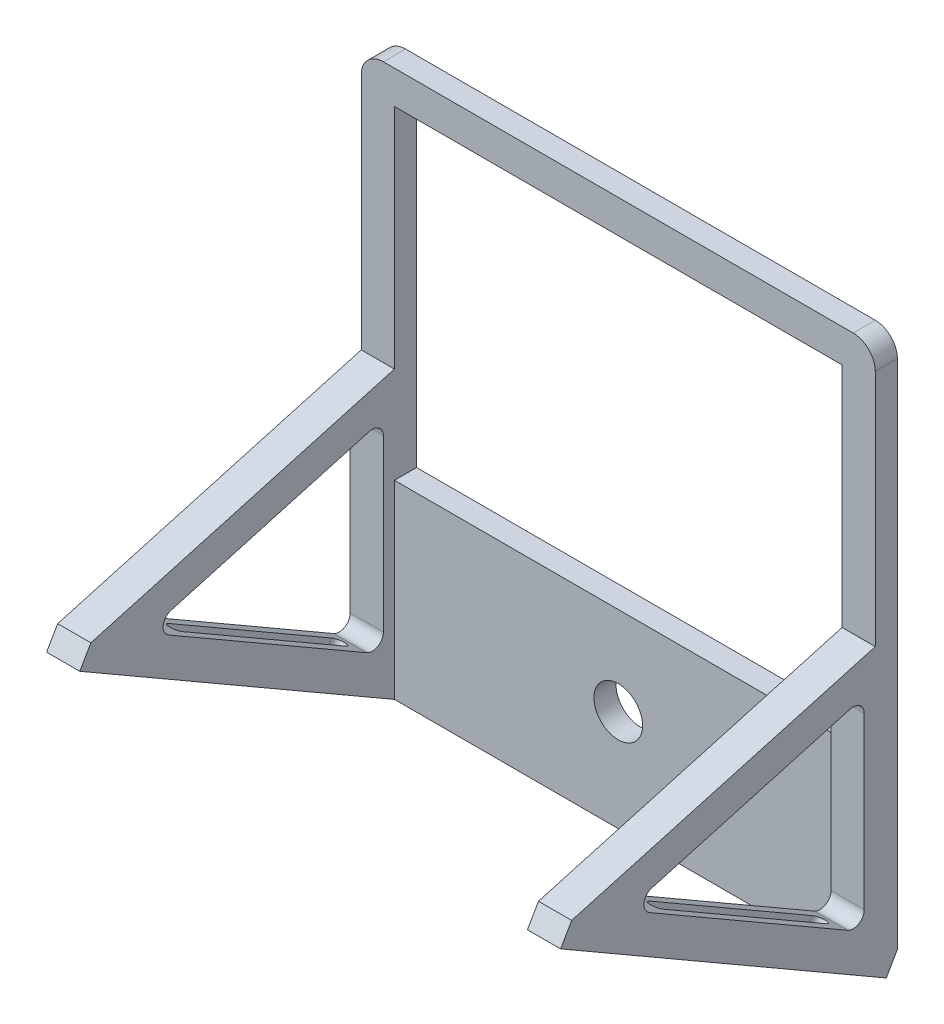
ISO-10303-21;
HEADER;
FILE_DESCRIPTION(('STEP AP214'),'2;1');
FILE_NAME('part.step','',(''),(''),'','','');
FILE_SCHEMA(('AUTOMOTIVE_DESIGN { 1 0 10303 214 1 1 1 1 }'));
ENDSEC;
DATA;
#1=APPLICATION_CONTEXT('core data for automotive mechanical design processes');
#2=APPLICATION_PROTOCOL_DEFINITION('international standard','automotive_design',2000,#1);
#3=PRODUCT_CONTEXT('',#1,'mechanical');
#4=PRODUCT('Part','Part','',(#3));
#5=PRODUCT_RELATED_PRODUCT_CATEGORY('part','',(#4));
#6=PRODUCT_DEFINITION_FORMATION('','',#4);
#7=PRODUCT_DEFINITION_CONTEXT('part definition',#1,'design');
#8=PRODUCT_DEFINITION('design','',#6,#7);
#9=PRODUCT_DEFINITION_SHAPE('','',#8);
#10=(LENGTH_UNIT() NAMED_UNIT(*) SI_UNIT(.MILLI.,.METRE.));
#11=(NAMED_UNIT(*) PLANE_ANGLE_UNIT() SI_UNIT($,.RADIAN.));
#12=(NAMED_UNIT(*) SI_UNIT($,.STERADIAN.) SOLID_ANGLE_UNIT());
#13=UNCERTAINTY_MEASURE_WITH_UNIT(LENGTH_MEASURE(1.E-05),#10,'distance_accuracy_value','');
#14=(GEOMETRIC_REPRESENTATION_CONTEXT(3) GLOBAL_UNCERTAINTY_ASSIGNED_CONTEXT((#13)) GLOBAL_UNIT_ASSIGNED_CONTEXT((#10,
#11,#12)) REPRESENTATION_CONTEXT('',''));
#15=CARTESIAN_POINT('',(0.,0.,0.));
#16=DIRECTION('',(0.,0.,1.));
#17=DIRECTION('',(1.,0.,0.));
#18=AXIS2_PLACEMENT_3D('',#15,#16,#17);
#19=CARTESIAN_POINT('',(-294.896248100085,-68.1660425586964,147.224318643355));
#20=DIRECTION('',(0.,0.5,0.866025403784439));
#21=DIRECTION('',(0.,-0.866025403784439,0.5));
#22=AXIS2_PLACEMENT_3D('',#19,#20,#21);
#23=PLANE('',#22);
#24=DIRECTION('',(0.,-0.866025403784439,0.5));
#25=VECTOR('',#24,1.);
#26=CARTESIAN_POINT('',(-101.166042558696,-68.1660425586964,147.224318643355));
#27=LINE('',#26,#25);
#28=CARTESIAN_POINT('',(-101.166042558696,-68.1660425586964,147.224318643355));
#29=VERTEX_POINT('',#28);
#30=CARTESIAN_POINT('',(-101.166042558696,-76.8262965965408,152.224318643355));
#31=VERTEX_POINT('',#30);
#32=EDGE_CURVE('E442',#29,#31,#27,.T.);
#33=ORIENTED_EDGE('',*,*,#32,.F.);
#34=DIRECTION('',(1.,0.,0.));
#35=VECTOR('',#34,1.);
#36=CARTESIAN_POINT('',(-294.896248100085,-68.1660425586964,147.224318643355));
#37=LINE('',#36,#35);
#38=CARTESIAN_POINT('',(-116.166042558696,-68.1660425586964,147.224318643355));
#39=VERTEX_POINT('',#38);
#40=EDGE_CURVE('E574',#39,#29,#37,.T.);
#41=ORIENTED_EDGE('',*,*,#40,.F.);
#42=DIRECTION('',(0.,0.866025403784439,-0.5));
#43=VECTOR('',#42,1.);
#44=CARTESIAN_POINT('',(-116.166042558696,-68.1660425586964,147.224318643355));
#45=LINE('',#44,#43);
#46=CARTESIAN_POINT('',(-116.166042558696,-76.8262965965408,152.224318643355));
#47=VERTEX_POINT('',#46);
#48=EDGE_CURVE('E543',#47,#39,#45,.T.);
#49=ORIENTED_EDGE('',*,*,#48,.F.);
#50=DIRECTION('',(1.,0.,0.));
#51=VECTOR('',#50,1.);
#52=CARTESIAN_POINT('',(-294.896248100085,-76.8262965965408,152.224318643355));
#53=LINE('',#52,#51);
#54=EDGE_CURVE('E569',#47,#31,#53,.T.);
#55=ORIENTED_EDGE('',*,*,#54,.T.);
#56=EDGE_LOOP('',(#33,#41,#49,#55));
#57=FACE_BOUND('',#56,.T.);
#58=ADVANCED_FACE('F45',(#57),#23,.T.);
#59=CARTESIAN_POINT('',(-297.004299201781,-29.6132486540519,10.));
#60=DIRECTION('',(0.,0.962726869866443,0.270475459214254));
#61=DIRECTION('',(0.,-0.270475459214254,0.962726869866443));
#62=AXIS2_PLACEMENT_3D('',#59,#60,#61);
#63=PLANE('',#62);
#64=DIRECTION('',(0.,-0.270475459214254,0.962726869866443));
#65=VECTOR('',#64,1.);
#66=CARTESIAN_POINT('',(-101.166042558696,-29.6132486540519,9.99999999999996));
#67=LINE('',#66,#65);
#68=CARTESIAN_POINT('',(-101.166042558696,-29.6132486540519,10.));
#69=VERTEX_POINT('',#68);
#70=EDGE_CURVE('E439',#69,#29,#67,.T.);
#71=ORIENTED_EDGE('',*,*,#70,.F.);
#72=DIRECTION('',(1.,0.,0.));
#73=VECTOR('',#72,1.);
#74=CARTESIAN_POINT('',(-297.004299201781,-29.6132486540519,10.));
#75=LINE('',#74,#73);
#76=CARTESIAN_POINT('',(-116.166042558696,-29.6132486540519,10.));
#77=VERTEX_POINT('',#76);
#78=EDGE_CURVE('E536',#77,#69,#75,.T.);
#79=ORIENTED_EDGE('',*,*,#78,.F.);
#80=DIRECTION('',(0.,0.270475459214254,-0.962726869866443));
#81=VECTOR('',#80,1.);
#82=CARTESIAN_POINT('',(-116.166042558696,-29.6132486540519,10.));
#83=LINE('',#82,#81);
#84=EDGE_CURVE('E473',#39,#77,#83,.T.);
#85=ORIENTED_EDGE('',*,*,#84,.F.);
#86=ORIENTED_EDGE('',*,*,#40,.T.);
#87=EDGE_LOOP('',(#71,#79,#85,#86));
#88=FACE_BOUND('',#87,.T.);
#89=ADVANCED_FACE('F715',(#88),#63,.T.);
#90=CARTESIAN_POINT('',(-297.004299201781,-130.072031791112,15.));
#91=DIRECTION('',(0.,0.,-1.));
#92=DIRECTION('',(0.,1.,0.));
#93=AXIS2_PLACEMENT_3D('',#90,#91,#92);
#94=PLANE('',#93);
#95=DIRECTION('',(1.,0.,0.));
#96=VECTOR('',#95,1.);
#97=CARTESIAN_POINT('',(-297.004299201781,-130.072031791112,15.));
#98=LINE('',#97,#96);
#99=CARTESIAN_POINT('',(-116.166042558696,-130.072031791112,15.));
#100=VERTEX_POINT('',#99);
#101=CARTESIAN_POINT('',(-101.166042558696,-130.072031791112,15.));
#102=VERTEX_POINT('',#101);
#103=EDGE_CURVE('E528',#100,#102,#98,.T.);
#104=ORIENTED_EDGE('',*,*,#103,.T.);
#105=DIRECTION('',(0.,1.,0.));
#106=VECTOR('',#105,1.);
#107=CARTESIAN_POINT('',(-101.166042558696,-130.072031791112,15.));
#108=LINE('',#107,#106);
#109=CARTESIAN_POINT('',(-101.166042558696,-53.197045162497,15.));
#110=VERTEX_POINT('',#109);
#111=EDGE_CURVE('E435',#102,#110,#108,.T.);
#112=ORIENTED_EDGE('',*,*,#111,.T.);
#113=DIRECTION('',(1.,0.,0.));
#114=VECTOR('',#113,1.);
#115=CARTESIAN_POINT('',(-297.004299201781,-53.1970451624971,15.));
#116=LINE('',#115,#114);
#117=CARTESIAN_POINT('',(-116.166042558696,-53.197045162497,15.));
#118=VERTEX_POINT('',#117);
#119=EDGE_CURVE('E523',#118,#110,#116,.T.);
#120=ORIENTED_EDGE('',*,*,#119,.F.);
#121=DIRECTION('',(0.,-1.,0.));
#122=VECTOR('',#121,1.);
#123=CARTESIAN_POINT('',(-116.166042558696,-130.072031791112,15.));
#124=LINE('',#123,#122);
#125=EDGE_CURVE('E477',#118,#100,#124,.T.);
#126=ORIENTED_EDGE('',*,*,#125,.T.);
#127=EDGE_LOOP('',(#104,#112,#120,#126));
#128=FACE_BOUND('',#127,.T.);
#129=ADVANCED_FACE('F803',(#128),#94,.F.);
#130=CARTESIAN_POINT('',(-297.004299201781,-53.1970451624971,20.));
#131=DIRECTION('',(1.,0.,0.));
#132=DIRECTION('',(0.,1.,0.));
#133=AXIS2_PLACEMENT_3D('',#130,#131,#132);
#134=CYLINDRICAL_SURFACE('',#133,5.);
#135=ORIENTED_EDGE('',*,*,#119,.T.);
#136=CARTESIAN_POINT('',(-101.166042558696,-53.1970451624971,20.));
#137=DIRECTION('',(-1.,0.,0.));
#138=DIRECTION('',(0.,0.,1.));
#139=AXIS2_PLACEMENT_3D('',#136,#137,#138);
#140=CIRCLE('',#139,5.);
#141=CARTESIAN_POINT('',(-101.166042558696,-48.3834108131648,21.3523772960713));
#142=VERTEX_POINT('',#141);
#143=EDGE_CURVE('E431',#110,#142,#140,.F.);
#144=ORIENTED_EDGE('',*,*,#143,.T.);
#145=DIRECTION('',(1.,0.,0.));
#146=VECTOR('',#145,1.);
#147=CARTESIAN_POINT('',(-297.004299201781,-48.3834108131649,21.3523772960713));
#148=LINE('',#147,#146);
#149=CARTESIAN_POINT('',(-116.166042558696,-48.3834108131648,21.3523772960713));
#150=VERTEX_POINT('',#149);
#151=EDGE_CURVE('E518',#150,#142,#148,.T.);
#152=ORIENTED_EDGE('',*,*,#151,.F.);
#153=CARTESIAN_POINT('',(-116.166042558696,-53.1970451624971,20.));
#154=DIRECTION('',(1.,0.,0.));
#155=DIRECTION('',(0.,1.,0.));
#156=AXIS2_PLACEMENT_3D('',#153,#154,#155);
#157=CIRCLE('',#156,5.);
#158=EDGE_CURVE('E452',#150,#118,#157,.F.);
#159=ORIENTED_EDGE('',*,*,#158,.T.);
#160=EDGE_LOOP('',(#135,#144,#152,#159));
#161=FACE_BOUND('',#160,.T.);
#162=ADVANCED_FACE('F827',(#161),#134,.F.);
#163=CARTESIAN_POINT('',(-297.004299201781,-48.3834108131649,21.3523772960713));
#164=DIRECTION('',(0.,0.962726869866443,0.270475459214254));
#165=DIRECTION('',(0.,-0.270475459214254,0.962726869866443));
#166=AXIS2_PLACEMENT_3D('',#163,#164,#165);
#167=PLANE('',#166);
#168=ORIENTED_EDGE('',*,*,#151,.T.);
#169=DIRECTION('',(0.,-0.270475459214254,0.962726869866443));
#170=VECTOR('',#169,1.);
#171=CARTESIAN_POINT('',(-101.166042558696,-48.3834108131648,21.3523772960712));
#172=LINE('',#171,#170);
#173=CARTESIAN_POINT('',(-101.166042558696,-73.5469644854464,110.919206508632));
#174=VERTEX_POINT('',#173);
#175=EDGE_CURVE('E427',#142,#174,#172,.T.);
#176=ORIENTED_EDGE('',*,*,#175,.T.);
#177=DIRECTION('',(1.,0.,0.));
#178=VECTOR('',#177,1.);
#179=CARTESIAN_POINT('',(-297.004299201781,-73.5469644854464,110.919206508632));
#180=LINE('',#179,#178);
#181=CARTESIAN_POINT('',(-116.166042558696,-73.5469644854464,110.919206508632));
#182=VERTEX_POINT('',#181);
#183=EDGE_CURVE('E513',#182,#174,#180,.T.);
#184=ORIENTED_EDGE('',*,*,#183,.F.);
#185=DIRECTION('',(0.,0.270475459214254,-0.962726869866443));
#186=VECTOR('',#185,1.);
#187=CARTESIAN_POINT('',(-116.166042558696,-48.3834108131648,21.3523772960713));
#188=LINE('',#187,#186);
#189=EDGE_CURVE('E457',#182,#150,#188,.T.);
#190=ORIENTED_EDGE('',*,*,#189,.T.);
#191=EDGE_LOOP('',(#168,#176,#184,#190));
#192=FACE_BOUND('',#191,.T.);
#193=ADVANCED_FACE('F829',(#192),#167,.F.);
#194=CARTESIAN_POINT('',(-297.004299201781,-78.3605988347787,109.56682921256));
#195=DIRECTION('',(1.,0.,0.));
#196=DIRECTION('',(0.,1.,0.));
#197=AXIS2_PLACEMENT_3D('',#194,#195,#196);
#198=CYLINDRICAL_SURFACE('',#197,5.);
#199=ORIENTED_EDGE('',*,*,#183,.T.);
#200=CARTESIAN_POINT('',(-101.166042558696,-78.3605988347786,109.56682921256));
#201=DIRECTION('',(-1.,0.,0.));
#202=DIRECTION('',(0.,0.,1.));
#203=AXIS2_PLACEMENT_3D('',#200,#201,#202);
#204=CIRCLE('',#203,5.);
#205=CARTESIAN_POINT('',(-101.166042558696,-82.6907258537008,112.06682921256));
#206=VERTEX_POINT('',#205);
#207=EDGE_CURVE('E423',#174,#206,#204,.F.);
#208=ORIENTED_EDGE('',*,*,#207,.T.);
#209=DIRECTION('',(1.,0.,0.));
#210=VECTOR('',#209,1.);
#211=CARTESIAN_POINT('',(-297.004299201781,-82.6907258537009,112.06682921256));
#212=LINE('',#211,#210);
#213=CARTESIAN_POINT('',(-116.166042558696,-82.6907258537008,112.06682921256));
#214=VERTEX_POINT('',#213);
#215=EDGE_CURVE('E508',#214,#206,#212,.T.);
#216=ORIENTED_EDGE('',*,*,#215,.F.);
#217=CARTESIAN_POINT('',(-116.166042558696,-78.3605988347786,109.56682921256));
#218=DIRECTION('',(1.,0.,0.));
#219=DIRECTION('',(0.,1.,0.));
#220=AXIS2_PLACEMENT_3D('',#217,#218,#219);
#221=CIRCLE('',#220,5.);
#222=EDGE_CURVE('E461',#214,#182,#221,.F.);
#223=ORIENTED_EDGE('',*,*,#222,.T.);
#224=EDGE_LOOP('',(#199,#208,#216,#223));
#225=FACE_BOUND('',#224,.T.);
#226=ADVANCED_FACE('F793',(#225),#198,.F.);
#227=CARTESIAN_POINT('',(-297.004299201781,-82.6907258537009,112.06682921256));
#228=DIRECTION('',(0.,-0.866025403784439,0.5));
#229=DIRECTION('',(0.,-0.5,-0.866025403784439));
#230=AXIS2_PLACEMENT_3D('',#227,#228,#229);
#231=PLANE('',#230);
#232=DIRECTION('',(0.,-0.5,-0.866025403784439));
#233=VECTOR('',#232,1.);
#234=CARTESIAN_POINT('',(-105.466042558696,-88.835915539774,101.423048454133));
#235=LINE('',#234,#233);
#236=CARTESIAN_POINT('',(-105.466042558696,-88.8359155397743,101.423048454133));
#237=VERTEX_POINT('',#236);
#238=CARTESIAN_POINT('',(-105.466042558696,-131.335915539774,27.8108891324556));
#239=VERTEX_POINT('',#238);
#240=EDGE_CURVE('E301',#237,#239,#235,.T.);
#241=ORIENTED_EDGE('',*,*,#240,.F.);
#242=CARTESIAN_POINT('',(-108.666042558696,-88.8359155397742,101.423048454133));
#243=DIRECTION('',(0.,-0.866025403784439,0.5));
#244=DIRECTION('',(0.,-0.5,-0.866025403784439));
#245=AXIS2_PLACEMENT_3D('',#242,#243,#244);
#246=CIRCLE('',#245,3.19999999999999);
#247=CARTESIAN_POINT('',(-111.866042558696,-88.8359155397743,101.423048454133));
#248=VERTEX_POINT('',#247);
#249=EDGE_CURVE('E309',#248,#237,#246,.F.);
#250=ORIENTED_EDGE('',*,*,#249,.F.);
#251=DIRECTION('',(0.,0.5,0.866025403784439));
#252=VECTOR('',#251,1.);
#253=CARTESIAN_POINT('',(-111.866042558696,-88.835915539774,101.423048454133));
#254=LINE('',#253,#252);
#255=CARTESIAN_POINT('',(-111.866042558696,-131.335915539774,27.8108891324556));
#256=VERTEX_POINT('',#255);
#257=EDGE_CURVE('E315',#256,#248,#254,.T.);
#258=ORIENTED_EDGE('',*,*,#257,.F.);
#259=CARTESIAN_POINT('',(-108.666042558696,-131.335915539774,27.8108891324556));
#260=DIRECTION('',(0.,-0.866025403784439,0.5));
#261=DIRECTION('',(0.,-0.5,-0.866025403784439));
#262=AXIS2_PLACEMENT_3D('',#259,#260,#261);
#263=CIRCLE('',#262,3.19999999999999);
#264=EDGE_CURVE('E64',#239,#256,#263,.F.);
#265=ORIENTED_EDGE('',*,*,#264,.F.);
#266=EDGE_LOOP('',(#241,#250,#258,#265));
#267=FACE_BOUND('',#266,.T.);
#268=ORIENTED_EDGE('',*,*,#215,.T.);
#269=DIRECTION('',(0.,-0.5,-0.866025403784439));
#270=VECTOR('',#269,1.);
#271=CARTESIAN_POINT('',(-101.166042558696,-82.6907258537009,112.06682921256));
#272=LINE('',#271,#270);
#273=CARTESIAN_POINT('',(-101.166042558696,-134.402158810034,22.5));
#274=VERTEX_POINT('',#273);
#275=EDGE_CURVE('E419',#206,#274,#272,.T.);
#276=ORIENTED_EDGE('',*,*,#275,.T.);
#277=DIRECTION('',(1.,0.,0.));
#278=VECTOR('',#277,1.);
#279=CARTESIAN_POINT('',(-297.004299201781,-134.402158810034,22.5));
#280=LINE('',#279,#278);
#281=CARTESIAN_POINT('',(-116.166042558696,-134.402158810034,22.5));
#282=VERTEX_POINT('',#281);
#283=EDGE_CURVE('E502',#282,#274,#280,.T.);
#284=ORIENTED_EDGE('',*,*,#283,.F.);
#285=DIRECTION('',(0.,0.5,0.866025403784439));
#286=VECTOR('',#285,1.);
#287=CARTESIAN_POINT('',(-116.166042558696,-82.6907258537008,112.06682921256));
#288=LINE('',#287,#286);
#289=EDGE_CURVE('E465',#282,#214,#288,.T.);
#290=ORIENTED_EDGE('',*,*,#289,.T.);
#291=EDGE_LOOP('',(#268,#276,#284,#290));
#292=FACE_BOUND('',#291,.T.);
#293=ADVANCED_FACE('F317',(#267,#292),#231,.F.);
#294=CARTESIAN_POINT('',(-297.004299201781,-130.072031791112,20.));
#295=DIRECTION('',(1.,0.,0.));
#296=DIRECTION('',(0.,1.,0.));
#297=AXIS2_PLACEMENT_3D('',#294,#295,#296);
#298=CYLINDRICAL_SURFACE('',#297,5.);
#299=ORIENTED_EDGE('',*,*,#283,.T.);
#300=CARTESIAN_POINT('',(-101.166042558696,-130.072031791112,20.));
#301=DIRECTION('',(-1.,0.,0.));
#302=DIRECTION('',(0.,0.,1.));
#303=AXIS2_PLACEMENT_3D('',#300,#301,#302);
#304=CIRCLE('',#303,5.);
#305=EDGE_CURVE('E651',#274,#102,#304,.F.);
#306=ORIENTED_EDGE('',*,*,#305,.T.);
#307=ORIENTED_EDGE('',*,*,#103,.F.);
#308=CARTESIAN_POINT('',(-116.166042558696,-130.072031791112,20.));
#309=DIRECTION('',(1.,0.,0.));
#310=DIRECTION('',(0.,1.,0.));
#311=AXIS2_PLACEMENT_3D('',#308,#309,#310);
#312=CIRCLE('',#311,5.);
#313=EDGE_CURVE('E469',#100,#282,#312,.F.);
#314=ORIENTED_EDGE('',*,*,#313,.T.);
#315=EDGE_LOOP('',(#299,#306,#307,#314));
#316=FACE_BOUND('',#315,.T.);
#317=ADVANCED_FACE('F791',(#316),#298,.F.);
#318=CARTESIAN_POINT('',(0.,0.,10.));
#319=DIRECTION('',(0.,0.,1.));
#320=DIRECTION('',(1.,0.,0.));
#321=AXIS2_PLACEMENT_3D('',#318,#319,#320);
#322=PLANE('',#321);
#323=DIRECTION('',(0.,1.,0.));
#324=VECTOR('',#323,1.);
#325=CARTESIAN_POINT('',(116.166042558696,88.1660425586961,10.));
#326=LINE('',#325,#324);
#327=CARTESIAN_POINT('',(116.166042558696,-29.6132486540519,10.));
#328=VERTEX_POINT('',#327);
#329=CARTESIAN_POINT('',(116.166042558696,78.1660425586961,10.));
#330=VERTEX_POINT('',#329);
#331=EDGE_CURVE('E625',#328,#330,#326,.T.);
#332=ORIENTED_EDGE('',*,*,#331,.T.);
#333=CARTESIAN_POINT('',(106.166042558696,78.1660425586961,10.));
#334=DIRECTION('',(0.,0.,1.));
#335=DIRECTION('',(1.,0.,0.));
#336=AXIS2_PLACEMENT_3D('',#333,#334,#335);
#337=CIRCLE('',#336,10.);
#338=CARTESIAN_POINT('',(106.166042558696,88.1660425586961,10.));
#339=VERTEX_POINT('',#338);
#340=EDGE_CURVE('E54',#330,#339,#337,.T.);
#341=ORIENTED_EDGE('',*,*,#340,.T.);
#342=DIRECTION('',(-1.,0.,0.));
#343=VECTOR('',#342,1.);
#344=CARTESIAN_POINT('',(-116.166042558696,88.1660425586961,10.));
#345=LINE('',#344,#343);
#346=CARTESIAN_POINT('',(-106.166042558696,88.1660425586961,10.));
#347=VERTEX_POINT('',#346);
#348=EDGE_CURVE('E630',#339,#347,#345,.T.);
#349=ORIENTED_EDGE('',*,*,#348,.T.);
#350=CARTESIAN_POINT('',(-106.166042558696,78.1660425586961,10.));
#351=DIRECTION('',(0.,0.,1.));
#352=DIRECTION('',(1.,0.,0.));
#353=AXIS2_PLACEMENT_3D('',#350,#351,#352);
#354=CIRCLE('',#353,10.);
#355=CARTESIAN_POINT('',(-116.166042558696,78.1660425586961,10.));
#356=VERTEX_POINT('',#355);
#357=EDGE_CURVE('E671',#347,#356,#354,.T.);
#358=ORIENTED_EDGE('',*,*,#357,.T.);
#359=DIRECTION('',(0.,-1.,0.));
#360=VECTOR('',#359,1.);
#361=CARTESIAN_POINT('',(-116.166042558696,88.1660425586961,10.));
#362=LINE('',#361,#360);
#363=EDGE_CURVE('E622',#356,#77,#362,.T.);
#364=ORIENTED_EDGE('',*,*,#363,.T.);
#365=ORIENTED_EDGE('',*,*,#78,.T.);
#366=DIRECTION('',(0.,-1.,0.));
#367=VECTOR('',#366,1.);
#368=CARTESIAN_POINT('',(-101.166042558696,73.1660425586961,10.));
#369=LINE('',#368,#367);
#370=CARTESIAN_POINT('',(-101.166042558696,73.1660425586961,10.));
#371=VERTEX_POINT('',#370);
#372=EDGE_CURVE('E578',#371,#69,#369,.T.);
#373=ORIENTED_EDGE('',*,*,#372,.F.);
#374=DIRECTION('',(-1.,0.,0.));
#375=VECTOR('',#374,1.);
#376=CARTESIAN_POINT('',(-101.166042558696,73.1660425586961,10.));
#377=LINE('',#376,#375);
#378=CARTESIAN_POINT('',(101.166042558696,73.1660425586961,10.));
#379=VERTEX_POINT('',#378);
#380=EDGE_CURVE('E590',#379,#371,#377,.T.);
#381=ORIENTED_EDGE('',*,*,#380,.F.);
#382=DIRECTION('',(0.,1.,0.));
#383=VECTOR('',#382,1.);
#384=CARTESIAN_POINT('',(101.166042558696,73.1660425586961,10.));
#385=LINE('',#384,#383);
#386=CARTESIAN_POINT('',(101.166042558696,-29.6132486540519,10.));
#387=VERTEX_POINT('',#386);
#388=EDGE_CURVE('E587',#387,#379,#385,.T.);
#389=ORIENTED_EDGE('',*,*,#388,.F.);
#390=EDGE_CURVE('E535',#387,#328,#75,.T.);
#391=ORIENTED_EDGE('',*,*,#390,.T.);
#392=EDGE_LOOP('',(#332,#341,#349,#358,#364,#365,#373,#381,#389,#391));
#393=FACE_BOUND('',#392,.T.);
#394=ADVANCED_FACE('F677',(#393),#322,.T.);
#395=CARTESIAN_POINT('',(0.,0.,0.));
#396=DIRECTION('',(0.,0.,1.));
#397=DIRECTION('',(1.,0.,0.));
#398=AXIS2_PLACEMENT_3D('',#395,#396,#397);
#399=PLANE('',#398);
#400=CARTESIAN_POINT('',(0.,-113.166042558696,0.));
#401=DIRECTION('',(0.,0.,-1.));
#402=DIRECTION('',(-1.,0.,0.));
#403=AXIS2_PLACEMENT_3D('',#400,#401,#402);
#404=CIRCLE('',#403,11.);
#405=CARTESIAN_POINT('',(-11.,-113.166042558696,0.));
#406=VERTEX_POINT('',#405);
#407=EDGE_CURVE('E322',#406,#406,#404,.T.);
#408=ORIENTED_EDGE('',*,*,#407,.F.);
#409=EDGE_LOOP('',(#408));
#410=FACE_BOUND('',#409,.T.);
#411=DIRECTION('',(-1.,0.,0.));
#412=VECTOR('',#411,1.);
#413=CARTESIAN_POINT('',(-116.166042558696,88.1660425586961,0.));
#414=LINE('',#413,#412);
#415=CARTESIAN_POINT('',(106.166042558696,88.1660425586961,0.));
#416=VERTEX_POINT('',#415);
#417=CARTESIAN_POINT('',(-106.166042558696,88.1660425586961,0.));
#418=VERTEX_POINT('',#417);
#419=EDGE_CURVE('E626',#416,#418,#414,.T.);
#420=ORIENTED_EDGE('',*,*,#419,.F.);
#421=CARTESIAN_POINT('',(106.166042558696,78.1660425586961,0.));
#422=DIRECTION('',(0.,0.,1.));
#423=DIRECTION('',(1.,0.,0.));
#424=AXIS2_PLACEMENT_3D('',#421,#422,#423);
#425=CIRCLE('',#424,10.);
#426=CARTESIAN_POINT('',(116.166042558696,78.1660425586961,0.));
#427=VERTEX_POINT('',#426);
#428=EDGE_CURVE('E665',#416,#427,#425,.F.);
#429=ORIENTED_EDGE('',*,*,#428,.T.);
#430=DIRECTION('',(0.,1.,0.));
#431=VECTOR('',#430,1.);
#432=CARTESIAN_POINT('',(116.166042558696,88.1660425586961,0.));
#433=LINE('',#432,#431);
#434=CARTESIAN_POINT('',(116.166042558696,-153.166042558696,0.));
#435=VERTEX_POINT('',#434);
#436=EDGE_CURVE('E641',#435,#427,#433,.T.);
#437=ORIENTED_EDGE('',*,*,#436,.F.);
#438=DIRECTION('',(1.,0.,0.));
#439=VECTOR('',#438,1.);
#440=CARTESIAN_POINT('',(-116.166042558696,-153.166042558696,0.));
#441=LINE('',#440,#439);
#442=CARTESIAN_POINT('',(-116.166042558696,-153.166042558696,0.));
#443=VERTEX_POINT('',#442);
#444=EDGE_CURVE('E637',#443,#435,#441,.T.);
#445=ORIENTED_EDGE('',*,*,#444,.F.);
#446=DIRECTION('',(0.,-1.,0.));
#447=VECTOR('',#446,1.);
#448=CARTESIAN_POINT('',(-116.166042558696,88.1660425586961,0.));
#449=LINE('',#448,#447);
#450=CARTESIAN_POINT('',(-116.166042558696,78.1660425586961,0.));
#451=VERTEX_POINT('',#450);
#452=EDGE_CURVE('E621',#451,#443,#449,.T.);
#453=ORIENTED_EDGE('',*,*,#452,.F.);
#454=CARTESIAN_POINT('',(-106.166042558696,78.1660425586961,0.));
#455=DIRECTION('',(0.,0.,1.));
#456=DIRECTION('',(1.,0.,0.));
#457=AXIS2_PLACEMENT_3D('',#454,#455,#456);
#458=CIRCLE('',#457,10.);
#459=EDGE_CURVE('E662',#451,#418,#458,.F.);
#460=ORIENTED_EDGE('',*,*,#459,.T.);
#461=EDGE_LOOP('',(#420,#429,#437,#445,#453,#460));
#462=FACE_BOUND('',#461,.T.);
#463=DIRECTION('',(0.,-1.,0.));
#464=VECTOR('',#463,1.);
#465=CARTESIAN_POINT('',(-101.166042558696,73.1660425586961,0.));
#466=LINE('',#465,#464);
#467=CARTESIAN_POINT('',(-101.166042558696,73.1660425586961,0.));
#468=VERTEX_POINT('',#467);
#469=CARTESIAN_POINT('',(-101.166042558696,-73.1660425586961,0.));
#470=VERTEX_POINT('',#469);
#471=EDGE_CURVE('E554',#468,#470,#466,.T.);
#472=ORIENTED_EDGE('',*,*,#471,.T.);
#473=DIRECTION('',(1.,0.,0.));
#474=VECTOR('',#473,1.);
#475=CARTESIAN_POINT('',(-101.166042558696,-73.1660425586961,0.));
#476=LINE('',#475,#474);
#477=CARTESIAN_POINT('',(101.166042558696,-73.1660425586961,0.));
#478=VERTEX_POINT('',#477);
#479=EDGE_CURVE('E597',#470,#478,#476,.T.);
#480=ORIENTED_EDGE('',*,*,#479,.T.);
#481=DIRECTION('',(0.,1.,0.));
#482=VECTOR('',#481,1.);
#483=CARTESIAN_POINT('',(101.166042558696,73.1660425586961,0.));
#484=LINE('',#483,#482);
#485=CARTESIAN_POINT('',(101.166042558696,73.1660425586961,0.));
#486=VERTEX_POINT('',#485);
#487=EDGE_CURVE('E601',#478,#486,#484,.T.);
#488=ORIENTED_EDGE('',*,*,#487,.T.);
#489=DIRECTION('',(-1.,0.,0.));
#490=VECTOR('',#489,1.);
#491=CARTESIAN_POINT('',(-101.166042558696,73.1660425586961,0.));
#492=LINE('',#491,#490);
#493=EDGE_CURVE('E583',#486,#468,#492,.T.);
#494=ORIENTED_EDGE('',*,*,#493,.T.);
#495=EDGE_LOOP('',(#472,#480,#488,#494));
#496=FACE_BOUND('',#495,.T.);
#497=ADVANCED_FACE('F690',(#410,#462,#496),#399,.F.);
#498=CARTESIAN_POINT('',(-116.166042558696,88.1660425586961,10.));
#499=DIRECTION('',(1.,0.,0.));
#500=DIRECTION('',(0.,1.,0.));
#501=AXIS2_PLACEMENT_3D('',#498,#499,#500);
#502=PLANE('',#501);
#503=ORIENTED_EDGE('',*,*,#363,.F.);
#504=DIRECTION('',(0.,0.,-1.));
#505=VECTOR('',#504,1.);
#506=CARTESIAN_POINT('',(-116.166042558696,78.1660425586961,10.));
#507=LINE('',#506,#505);
#508=EDGE_CURVE('E11',#356,#451,#507,.T.);
#509=ORIENTED_EDGE('',*,*,#508,.T.);
#510=ORIENTED_EDGE('',*,*,#452,.T.);
#511=DIRECTION('',(0.,-0.866025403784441,0.499999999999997));
#512=VECTOR('',#511,1.);
#513=CARTESIAN_POINT('',(-116.166042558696,-153.166042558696,0.));
#514=LINE('',#513,#512);
#515=CARTESIAN_POINT('',(-116.166042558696,-161.82629659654,4.99999999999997));
#516=VERTEX_POINT('',#515);
#517=EDGE_CURVE('E551',#443,#516,#514,.T.);
#518=ORIENTED_EDGE('',*,*,#517,.T.);
#519=DIRECTION('',(0.,0.499999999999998,0.86602540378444));
#520=VECTOR('',#519,1.);
#521=CARTESIAN_POINT('',(-116.166042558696,-161.82629659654,4.99999999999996));
#522=LINE('',#521,#520);
#523=EDGE_CURVE('E547',#516,#47,#522,.T.);
#524=ORIENTED_EDGE('',*,*,#523,.T.);
#525=ORIENTED_EDGE('',*,*,#48,.T.);
#526=ORIENTED_EDGE('',*,*,#84,.T.);
#527=EDGE_LOOP('',(#503,#509,#510,#518,#524,#525,#526));
#528=FACE_BOUND('',#527,.T.);
#529=ORIENTED_EDGE('',*,*,#125,.F.);
#530=ORIENTED_EDGE('',*,*,#158,.F.);
#531=ORIENTED_EDGE('',*,*,#189,.F.);
#532=ORIENTED_EDGE('',*,*,#222,.F.);
#533=ORIENTED_EDGE('',*,*,#289,.F.);
#534=ORIENTED_EDGE('',*,*,#313,.F.);
#535=EDGE_LOOP('',(#529,#530,#531,#532,#533,#534));
#536=FACE_BOUND('',#535,.T.);
#537=ADVANCED_FACE('F705',(#528,#536),#502,.F.);
#538=CARTESIAN_POINT('',(116.166042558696,88.1660425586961,10.));
#539=DIRECTION('',(-1.,0.,0.));
#540=DIRECTION('',(0.,-1.,0.));
#541=AXIS2_PLACEMENT_3D('',#538,#539,#540);
#542=PLANE('',#541);
#543=ORIENTED_EDGE('',*,*,#436,.T.);
#544=DIRECTION('',(0.,0.,-1.));
#545=VECTOR('',#544,1.);
#546=CARTESIAN_POINT('',(116.166042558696,78.1660425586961,10.));
#547=LINE('',#546,#545);
#548=EDGE_CURVE('E668',#427,#330,#547,.F.);
#549=ORIENTED_EDGE('',*,*,#548,.T.);
#550=ORIENTED_EDGE('',*,*,#331,.F.);
#551=DIRECTION('',(0.,-0.270475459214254,0.962726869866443));
#552=VECTOR('',#551,1.);
#553=CARTESIAN_POINT('',(116.166042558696,-29.6132486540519,10.));
#554=LINE('',#553,#552);
#555=CARTESIAN_POINT('',(116.166042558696,-68.1660425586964,147.224318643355));
#556=VERTEX_POINT('',#555);
#557=EDGE_CURVE('E506',#328,#556,#554,.T.);
#558=ORIENTED_EDGE('',*,*,#557,.T.);
#559=DIRECTION('',(0.,-0.866025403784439,0.5));
#560=VECTOR('',#559,1.);
#561=CARTESIAN_POINT('',(116.166042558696,-68.1660425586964,147.224318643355));
#562=LINE('',#561,#560);
#563=CARTESIAN_POINT('',(116.166042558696,-76.8262965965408,152.224318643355));
#564=VERTEX_POINT('',#563);
#565=EDGE_CURVE('E558',#556,#564,#562,.T.);
#566=ORIENTED_EDGE('',*,*,#565,.T.);
#567=DIRECTION('',(0.,-0.499999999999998,-0.86602540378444));
#568=VECTOR('',#567,1.);
#569=CARTESIAN_POINT('',(116.166042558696,-161.82629659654,4.99999999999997));
#570=LINE('',#569,#568);
#571=CARTESIAN_POINT('',(116.166042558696,-161.82629659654,4.99999999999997));
#572=VERTEX_POINT('',#571);
#573=EDGE_CURVE('E562',#564,#572,#570,.T.);
#574=ORIENTED_EDGE('',*,*,#573,.T.);
#575=DIRECTION('',(0.,0.86602540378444,-0.499999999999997));
#576=VECTOR('',#575,1.);
#577=CARTESIAN_POINT('',(116.166042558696,-153.166042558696,0.));
#578=LINE('',#577,#576);
#579=EDGE_CURVE('E456',#572,#435,#578,.T.);
#580=ORIENTED_EDGE('',*,*,#579,.T.);
#581=EDGE_LOOP('',(#543,#549,#550,#558,#566,#574,#580));
#582=FACE_BOUND('',#581,.T.);
#583=DIRECTION('',(0.,1.,0.));
#584=VECTOR('',#583,1.);
#585=CARTESIAN_POINT('',(116.166042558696,-130.072031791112,15.));
#586=LINE('',#585,#584);
#587=CARTESIAN_POINT('',(116.166042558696,-130.072031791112,15.));
#588=VERTEX_POINT('',#587);
#589=CARTESIAN_POINT('',(116.166042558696,-53.197045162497,15.));
#590=VERTEX_POINT('',#589);
#591=EDGE_CURVE('E481',#588,#590,#586,.T.);
#592=ORIENTED_EDGE('',*,*,#591,.F.);
#593=CARTESIAN_POINT('',(116.166042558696,-130.072031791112,20.));
#594=DIRECTION('',(1.,0.,0.));
#595=DIRECTION('',(0.,-1.,0.));
#596=AXIS2_PLACEMENT_3D('',#593,#594,#595);
#597=CIRCLE('',#596,5.);
#598=CARTESIAN_POINT('',(116.166042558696,-134.402158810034,22.5));
#599=VERTEX_POINT('',#598);
#600=EDGE_CURVE('E451',#599,#588,#597,.T.);
#601=ORIENTED_EDGE('',*,*,#600,.F.);
#602=DIRECTION('',(0.,-0.5,-0.866025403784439));
#603=VECTOR('',#602,1.);
#604=CARTESIAN_POINT('',(116.166042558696,-82.6907258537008,112.06682921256));
#605=LINE('',#604,#603);
#606=CARTESIAN_POINT('',(116.166042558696,-82.6907258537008,112.06682921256));
#607=VERTEX_POINT('',#606);
#608=EDGE_CURVE('E497',#607,#599,#605,.T.);
#609=ORIENTED_EDGE('',*,*,#608,.F.);
#610=CARTESIAN_POINT('',(116.166042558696,-78.3605988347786,109.56682921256));
#611=DIRECTION('',(1.,0.,0.));
#612=DIRECTION('',(0.,-1.,0.));
#613=AXIS2_PLACEMENT_3D('',#610,#611,#612);
#614=CIRCLE('',#613,5.);
#615=CARTESIAN_POINT('',(116.166042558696,-73.5469644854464,110.919206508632));
#616=VERTEX_POINT('',#615);
#617=EDGE_CURVE('E493',#616,#607,#614,.T.);
#618=ORIENTED_EDGE('',*,*,#617,.F.);
#619=DIRECTION('',(0.,-0.270475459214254,0.962726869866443));
#620=VECTOR('',#619,1.);
#621=CARTESIAN_POINT('',(116.166042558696,-48.3834108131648,21.3523772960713));
#622=LINE('',#621,#620);
#623=CARTESIAN_POINT('',(116.166042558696,-48.3834108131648,21.3523772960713));
#624=VERTEX_POINT('',#623);
#625=EDGE_CURVE('E489',#624,#616,#622,.T.);
#626=ORIENTED_EDGE('',*,*,#625,.F.);
#627=CARTESIAN_POINT('',(116.166042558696,-53.197045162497,20.));
#628=DIRECTION('',(1.,0.,0.));
#629=DIRECTION('',(0.,1.,0.));
#630=AXIS2_PLACEMENT_3D('',#627,#628,#629);
#631=CIRCLE('',#630,5.);
#632=EDGE_CURVE('E485',#590,#624,#631,.T.);
#633=ORIENTED_EDGE('',*,*,#632,.F.);
#634=EDGE_LOOP('',(#592,#601,#609,#618,#626,#633));
#635=FACE_BOUND('',#634,.T.);
#636=ADVANCED_FACE('F694',(#582,#635),#542,.F.);
#637=CARTESIAN_POINT('',(-116.166042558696,88.1660425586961,10.));
#638=DIRECTION('',(0.,-1.,0.));
#639=DIRECTION('',(0.,0.,-1.));
#640=AXIS2_PLACEMENT_3D('',#637,#638,#639);
#641=PLANE('',#640);
#642=ORIENTED_EDGE('',*,*,#348,.F.);
#643=DIRECTION('',(0.,0.,-1.));
#644=VECTOR('',#643,1.);
#645=CARTESIAN_POINT('',(106.166042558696,88.1660425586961,10.));
#646=LINE('',#645,#644);
#647=EDGE_CURVE('E658',#339,#416,#646,.T.);
#648=ORIENTED_EDGE('',*,*,#647,.T.);
#649=ORIENTED_EDGE('',*,*,#419,.T.);
#650=DIRECTION('',(0.,0.,-1.));
#651=VECTOR('',#650,1.);
#652=CARTESIAN_POINT('',(-106.166042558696,88.1660425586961,10.));
#653=LINE('',#652,#651);
#654=EDGE_CURVE('E655',#418,#347,#653,.F.);
#655=ORIENTED_EDGE('',*,*,#654,.T.);
#656=EDGE_LOOP('',(#642,#648,#649,#655));
#657=FACE_BOUND('',#656,.T.);
#658=ADVANCED_FACE('F685',(#657),#641,.F.);
#659=CARTESIAN_POINT('',(-101.166042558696,73.1660425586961,10.));
#660=DIRECTION('',(1.,0.,0.));
#661=DIRECTION('',(0.,0.,-1.));
#662=AXIS2_PLACEMENT_3D('',#659,#660,#661);
#663=PLANE('',#662);
#664=ORIENTED_EDGE('',*,*,#471,.F.);
#665=DIRECTION('',(0.,0.,-1.));
#666=VECTOR('',#665,1.);
#667=CARTESIAN_POINT('',(-101.166042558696,73.1660425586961,10.));
#668=LINE('',#667,#666);
#669=EDGE_CURVE('E593',#371,#468,#668,.T.);
#670=ORIENTED_EDGE('',*,*,#669,.F.);
#671=ORIENTED_EDGE('',*,*,#372,.T.);
#672=ORIENTED_EDGE('',*,*,#70,.T.);
#673=ORIENTED_EDGE('',*,*,#32,.T.);
#674=DIRECTION('',(0.,-0.499999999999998,-0.86602540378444));
#675=VECTOR('',#674,1.);
#676=CARTESIAN_POINT('',(-101.166042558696,-161.826296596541,4.99999999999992));
#677=LINE('',#676,#675);
#678=CARTESIAN_POINT('',(-101.166042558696,-158.939545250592,10.));
#679=VERTEX_POINT('',#678);
#680=EDGE_CURVE('E445',#31,#679,#677,.T.);
#681=ORIENTED_EDGE('',*,*,#680,.T.);
#682=DIRECTION('',(0.,1.,0.));
#683=VECTOR('',#682,1.);
#684=CARTESIAN_POINT('',(-101.166042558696,-161.82629659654,10.));
#685=LINE('',#684,#683);
#686=CARTESIAN_POINT('',(-101.166042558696,-73.1660425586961,10.));
#687=VERTEX_POINT('',#686);
#688=EDGE_CURVE('E384',#679,#687,#685,.T.);
#689=ORIENTED_EDGE('',*,*,#688,.T.);
#690=DIRECTION('',(0.,0.,-1.));
#691=VECTOR('',#690,1.);
#692=CARTESIAN_POINT('',(-101.166042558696,-73.1660425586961,10.));
#693=LINE('',#692,#691);
#694=EDGE_CURVE('E617',#687,#470,#693,.T.);
#695=ORIENTED_EDGE('',*,*,#694,.T.);
#696=EDGE_LOOP('',(#664,#670,#671,#672,#673,#681,#689,#695));
#697=FACE_BOUND('',#696,.T.);
#698=ORIENTED_EDGE('',*,*,#305,.F.);
#699=ORIENTED_EDGE('',*,*,#275,.F.);
#700=ORIENTED_EDGE('',*,*,#207,.F.);
#701=ORIENTED_EDGE('',*,*,#175,.F.);
#702=ORIENTED_EDGE('',*,*,#143,.F.);
#703=ORIENTED_EDGE('',*,*,#111,.F.);
#704=EDGE_LOOP('',(#698,#699,#700,#701,#702,#703));
#705=FACE_BOUND('',#704,.T.);
#706=ADVANCED_FACE('F718',(#697,#705),#663,.T.);
#707=CARTESIAN_POINT('',(-101.166042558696,-73.1660425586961,10.));
#708=DIRECTION('',(0.,1.,0.));
#709=DIRECTION('',(0.,0.,1.));
#710=AXIS2_PLACEMENT_3D('',#707,#708,#709);
#711=PLANE('',#710);
#712=ORIENTED_EDGE('',*,*,#479,.F.);
#713=ORIENTED_EDGE('',*,*,#694,.F.);
#714=DIRECTION('',(1.,0.,0.));
#715=VECTOR('',#714,1.);
#716=CARTESIAN_POINT('',(-101.166042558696,-73.1660425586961,10.));
#717=LINE('',#716,#715);
#718=CARTESIAN_POINT('',(101.166042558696,-73.1660425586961,10.));
#719=VERTEX_POINT('',#718);
#720=EDGE_CURVE('E582',#687,#719,#717,.T.);
#721=ORIENTED_EDGE('',*,*,#720,.T.);
#722=DIRECTION('',(0.,0.,-1.));
#723=VECTOR('',#722,1.);
#724=CARTESIAN_POINT('',(101.166042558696,-73.1660425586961,10.));
#725=LINE('',#724,#723);
#726=EDGE_CURVE('E614',#719,#478,#725,.T.);
#727=ORIENTED_EDGE('',*,*,#726,.T.);
#728=EDGE_LOOP('',(#712,#713,#721,#727));
#729=FACE_BOUND('',#728,.T.);
#730=ADVANCED_FACE('F735',(#729),#711,.T.);
#731=CARTESIAN_POINT('',(101.166042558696,73.1660425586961,10.));
#732=DIRECTION('',(-1.,0.,0.));
#733=DIRECTION('',(0.,0.,1.));
#734=AXIS2_PLACEMENT_3D('',#731,#732,#733);
#735=PLANE('',#734);
#736=ORIENTED_EDGE('',*,*,#487,.F.);
#737=ORIENTED_EDGE('',*,*,#726,.F.);
#738=DIRECTION('',(0.,1.,0.));
#739=VECTOR('',#738,1.);
#740=CARTESIAN_POINT('',(101.166042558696,-161.82629659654,10.));
#741=LINE('',#740,#739);
#742=CARTESIAN_POINT('',(101.166042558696,-158.939545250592,10.));
#743=VERTEX_POINT('',#742);
#744=EDGE_CURVE('E383',#743,#719,#741,.T.);
#745=ORIENTED_EDGE('',*,*,#744,.F.);
#746=DIRECTION('',(0.,0.499999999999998,0.86602540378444));
#747=VECTOR('',#746,1.);
#748=CARTESIAN_POINT('',(101.166042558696,-161.82629659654,4.99999999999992));
#749=LINE('',#748,#747);
#750=CARTESIAN_POINT('',(101.166042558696,-76.8262965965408,152.224318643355));
#751=VERTEX_POINT('',#750);
#752=EDGE_CURVE('E416',#743,#751,#749,.T.);
#753=ORIENTED_EDGE('',*,*,#752,.T.);
#754=DIRECTION('',(0.,0.866025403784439,-0.5));
#755=VECTOR('',#754,1.);
#756=CARTESIAN_POINT('',(101.166042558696,-68.1660425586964,147.224318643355));
#757=LINE('',#756,#755);
#758=CARTESIAN_POINT('',(101.166042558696,-68.1660425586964,147.224318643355));
#759=VERTEX_POINT('',#758);
#760=EDGE_CURVE('E413',#751,#759,#757,.T.);
#761=ORIENTED_EDGE('',*,*,#760,.T.);
#762=DIRECTION('',(0.,0.270475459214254,-0.962726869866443));
#763=VECTOR('',#762,1.);
#764=CARTESIAN_POINT('',(101.166042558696,-29.6132486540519,9.99999999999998));
#765=LINE('',#764,#763);
#766=EDGE_CURVE('E410',#759,#387,#765,.T.);
#767=ORIENTED_EDGE('',*,*,#766,.T.);
#768=ORIENTED_EDGE('',*,*,#388,.T.);
#769=DIRECTION('',(0.,0.,-1.));
#770=VECTOR('',#769,1.);
#771=CARTESIAN_POINT('',(101.166042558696,73.1660425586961,10.));
#772=LINE('',#771,#770);
#773=EDGE_CURVE('E611',#379,#486,#772,.T.);
#774=ORIENTED_EDGE('',*,*,#773,.T.);
#775=EDGE_LOOP('',(#736,#737,#745,#753,#761,#767,#768,#774));
#776=FACE_BOUND('',#775,.T.);
#777=CARTESIAN_POINT('',(101.166042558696,-53.197045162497,20.));
#778=DIRECTION('',(1.,0.,0.));
#779=DIRECTION('',(0.,0.,-1.));
#780=AXIS2_PLACEMENT_3D('',#777,#778,#779);
#781=CIRCLE('',#780,5.);
#782=CARTESIAN_POINT('',(101.166042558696,-48.3834108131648,21.3523772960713));
#783=VERTEX_POINT('',#782);
#784=CARTESIAN_POINT('',(101.166042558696,-53.197045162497,15.));
#785=VERTEX_POINT('',#784);
#786=EDGE_CURVE('E402',#783,#785,#781,.F.);
#787=ORIENTED_EDGE('',*,*,#786,.F.);
#788=DIRECTION('',(0.,0.270475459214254,-0.962726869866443));
#789=VECTOR('',#788,1.);
#790=CARTESIAN_POINT('',(101.166042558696,-48.3834108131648,21.3523772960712));
#791=LINE('',#790,#789);
#792=CARTESIAN_POINT('',(101.166042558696,-73.5469644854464,110.919206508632));
#793=VERTEX_POINT('',#792);
#794=EDGE_CURVE('E398',#793,#783,#791,.T.);
#795=ORIENTED_EDGE('',*,*,#794,.F.);
#796=CARTESIAN_POINT('',(101.166042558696,-78.3605988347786,109.56682921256));
#797=DIRECTION('',(1.,0.,0.));
#798=DIRECTION('',(0.,0.,-1.));
#799=AXIS2_PLACEMENT_3D('',#796,#797,#798);
#800=CIRCLE('',#799,5.);
#801=CARTESIAN_POINT('',(101.166042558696,-82.6907258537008,112.06682921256));
#802=VERTEX_POINT('',#801);
#803=EDGE_CURVE('E394',#802,#793,#800,.F.);
#804=ORIENTED_EDGE('',*,*,#803,.F.);
#805=DIRECTION('',(0.,0.5,0.866025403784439));
#806=VECTOR('',#805,1.);
#807=CARTESIAN_POINT('',(101.166042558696,-82.6907258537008,112.06682921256));
#808=LINE('',#807,#806);
#809=CARTESIAN_POINT('',(101.166042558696,-134.402158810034,22.5));
#810=VERTEX_POINT('',#809);
#811=EDGE_CURVE('E388',#810,#802,#808,.T.);
#812=ORIENTED_EDGE('',*,*,#811,.F.);
#813=CARTESIAN_POINT('',(101.166042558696,-130.072031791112,20.));
#814=DIRECTION('',(1.,0.,0.));
#815=DIRECTION('',(0.,0.,-1.));
#816=AXIS2_PLACEMENT_3D('',#813,#814,#815);
#817=CIRCLE('',#816,5.);
#818=CARTESIAN_POINT('',(101.166042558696,-130.072031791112,15.));
#819=VERTEX_POINT('',#818);
#820=EDGE_CURVE('E634',#819,#810,#817,.F.);
#821=ORIENTED_EDGE('',*,*,#820,.F.);
#822=DIRECTION('',(0.,-1.,0.));
#823=VECTOR('',#822,1.);
#824=CARTESIAN_POINT('',(101.166042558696,-130.072031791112,15.));
#825=LINE('',#824,#823);
#826=EDGE_CURVE('E406',#785,#819,#825,.T.);
#827=ORIENTED_EDGE('',*,*,#826,.F.);
#828=EDGE_LOOP('',(#787,#795,#804,#812,#821,#827));
#829=FACE_BOUND('',#828,.T.);
#830=ADVANCED_FACE('F738',(#776,#829),#735,.T.);
#831=CARTESIAN_POINT('',(-101.166042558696,73.1660425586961,10.));
#832=DIRECTION('',(0.,-1.,0.));
#833=DIRECTION('',(0.,0.,-1.));
#834=AXIS2_PLACEMENT_3D('',#831,#832,#833);
#835=PLANE('',#834);
#836=ORIENTED_EDGE('',*,*,#493,.F.);
#837=ORIENTED_EDGE('',*,*,#773,.F.);
#838=ORIENTED_EDGE('',*,*,#380,.T.);
#839=ORIENTED_EDGE('',*,*,#669,.T.);
#840=EDGE_LOOP('',(#836,#837,#838,#839));
#841=FACE_BOUND('',#840,.T.);
#842=ADVANCED_FACE('F743',(#841),#835,.T.);
#843=CARTESIAN_POINT('',(-294.896248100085,-153.166042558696,0.));
#844=DIRECTION('',(0.,-0.499999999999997,-0.86602540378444));
#845=DIRECTION('',(0.,0.866025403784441,-0.499999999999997));
#846=AXIS2_PLACEMENT_3D('',#843,#844,#845);
#847=PLANE('',#846);
#848=ORIENTED_EDGE('',*,*,#517,.F.);
#849=ORIENTED_EDGE('',*,*,#444,.T.);
#850=ORIENTED_EDGE('',*,*,#579,.F.);
#851=DIRECTION('',(1.,0.,0.));
#852=VECTOR('',#851,1.);
#853=CARTESIAN_POINT('',(-294.896248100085,-161.826296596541,4.99999999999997));
#854=LINE('',#853,#852);
#855=EDGE_CURVE('E548',#516,#572,#854,.T.);
#856=ORIENTED_EDGE('',*,*,#855,.F.);
#857=EDGE_LOOP('',(#848,#849,#850,#856));
#858=FACE_BOUND('',#857,.T.);
#859=ADVANCED_FACE('F701',(#858),#847,.T.);
#860=CARTESIAN_POINT('',(-294.896248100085,-161.826296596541,4.99999999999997));
#861=DIRECTION('',(0.,-0.86602540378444,0.499999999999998));
#862=DIRECTION('',(0.,-0.499999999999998,-0.86602540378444));
#863=AXIS2_PLACEMENT_3D('',#860,#861,#862);
#864=PLANE('',#863);
#865=CARTESIAN_POINT('',(-108.666042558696,-101.826296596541,108.923048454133));
#866=DIRECTION('',(0.,-0.86602540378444,0.499999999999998));
#867=DIRECTION('',(0.,-0.499999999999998,-0.86602540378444));
#868=AXIS2_PLACEMENT_3D('',#865,#866,#867);
#869=CIRCLE('',#868,3.19999999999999);
#870=CARTESIAN_POINT('',(-105.466042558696,-101.826296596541,108.923048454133));
#871=VERTEX_POINT('',#870);
#872=CARTESIAN_POINT('',(-111.866042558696,-101.826296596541,108.923048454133));
#873=VERTEX_POINT('',#872);
#874=EDGE_CURVE('E72',#871,#873,#869,.T.);
#875=ORIENTED_EDGE('',*,*,#874,.F.);
#876=DIRECTION('',(0.,0.499999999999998,0.86602540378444));
#877=VECTOR('',#876,1.);
#878=CARTESIAN_POINT('',(-105.466042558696,-101.826296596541,108.923048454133));
#879=LINE('',#878,#877);
#880=CARTESIAN_POINT('',(-105.466042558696,-144.326296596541,35.3108891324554));
#881=VERTEX_POINT('',#880);
#882=EDGE_CURVE('E303',#881,#871,#879,.T.);
#883=ORIENTED_EDGE('',*,*,#882,.F.);
#884=CARTESIAN_POINT('',(-108.666042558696,-144.326296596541,35.3108891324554));
#885=DIRECTION('',(0.,-0.86602540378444,0.499999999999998));
#886=DIRECTION('',(0.,-0.499999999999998,-0.86602540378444));
#887=AXIS2_PLACEMENT_3D('',#884,#885,#886);
#888=CIRCLE('',#887,3.19999999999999);
#889=CARTESIAN_POINT('',(-111.866042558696,-144.326296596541,35.3108891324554));
#890=VERTEX_POINT('',#889);
#891=EDGE_CURVE('E905',#890,#881,#888,.T.);
#892=ORIENTED_EDGE('',*,*,#891,.F.);
#893=DIRECTION('',(0.,-0.499999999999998,-0.86602540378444));
#894=VECTOR('',#893,1.);
#895=CARTESIAN_POINT('',(-111.866042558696,-101.826296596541,108.923048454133));
#896=LINE('',#895,#894);
#897=EDGE_CURVE('E911',#873,#890,#896,.T.);
#898=ORIENTED_EDGE('',*,*,#897,.F.);
#899=EDGE_LOOP('',(#875,#883,#892,#898));
#900=FACE_BOUND('',#899,.T.);
#901=DIRECTION('',(0.,-0.499999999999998,-0.86602540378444));
#902=VECTOR('',#901,1.);
#903=CARTESIAN_POINT('',(105.466042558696,-101.826296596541,108.923048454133));
#904=LINE('',#903,#902);
#905=CARTESIAN_POINT('',(105.466042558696,-101.826296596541,108.923048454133));
#906=VERTEX_POINT('',#905);
#907=CARTESIAN_POINT('',(105.466042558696,-144.326296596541,35.3108891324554));
#908=VERTEX_POINT('',#907);
#909=EDGE_CURVE('E346',#906,#908,#904,.T.);
#910=ORIENTED_EDGE('',*,*,#909,.F.);
#911=CARTESIAN_POINT('',(108.666042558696,-101.826296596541,108.923048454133));
#912=DIRECTION('',(0.,-0.86602540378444,0.499999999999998));
#913=DIRECTION('',(0.,0.499999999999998,0.86602540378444));
#914=AXIS2_PLACEMENT_3D('',#911,#912,#913);
#915=CIRCLE('',#914,3.19999999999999);
#916=CARTESIAN_POINT('',(111.866042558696,-101.826296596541,108.923048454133));
#917=VERTEX_POINT('',#916);
#918=EDGE_CURVE('E350',#917,#906,#915,.T.);
#919=ORIENTED_EDGE('',*,*,#918,.F.);
#920=DIRECTION('',(0.,0.499999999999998,0.86602540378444));
#921=VECTOR('',#920,1.);
#922=CARTESIAN_POINT('',(111.866042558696,-101.826296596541,108.923048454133));
#923=LINE('',#922,#921);
#924=CARTESIAN_POINT('',(111.866042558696,-144.326296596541,35.3108891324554));
#925=VERTEX_POINT('',#924);
#926=EDGE_CURVE('E338',#925,#917,#923,.T.);
#927=ORIENTED_EDGE('',*,*,#926,.F.);
#928=CARTESIAN_POINT('',(108.666042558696,-144.326296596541,35.3108891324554));
#929=DIRECTION('',(0.,-0.86602540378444,0.499999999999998));
#930=DIRECTION('',(0.,0.499999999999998,0.86602540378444));
#931=AXIS2_PLACEMENT_3D('',#928,#929,#930);
#932=CIRCLE('',#931,3.19999999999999);
#933=EDGE_CURVE('E342',#908,#925,#932,.T.);
#934=ORIENTED_EDGE('',*,*,#933,.F.);
#935=EDGE_LOOP('',(#910,#919,#927,#934));
#936=FACE_BOUND('',#935,.T.);
#937=ORIENTED_EDGE('',*,*,#680,.F.);
#938=ORIENTED_EDGE('',*,*,#54,.F.);
#939=ORIENTED_EDGE('',*,*,#523,.F.);
#940=ORIENTED_EDGE('',*,*,#855,.T.);
#941=ORIENTED_EDGE('',*,*,#573,.F.);
#942=EDGE_CURVE('E573',#751,#564,#53,.T.);
#943=ORIENTED_EDGE('',*,*,#942,.F.);
#944=ORIENTED_EDGE('',*,*,#752,.F.);
#945=DIRECTION('',(1.,0.,0.));
#946=VECTOR('',#945,1.);
#947=CARTESIAN_POINT('',(-294.896248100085,-158.939545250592,10.));
#948=LINE('',#947,#946);
#949=EDGE_CURVE('E448',#679,#743,#948,.T.);
#950=ORIENTED_EDGE('',*,*,#949,.F.);
#951=EDGE_LOOP('',(#937,#938,#939,#940,#941,#943,#944,#950));
#952=FACE_BOUND('',#951,.T.);
#953=ADVANCED_FACE('F725',(#900,#936,#952),#864,.T.);
#954=ORIENTED_EDGE('',*,*,#760,.F.);
#955=ORIENTED_EDGE('',*,*,#942,.T.);
#956=ORIENTED_EDGE('',*,*,#565,.F.);
#957=EDGE_CURVE('E566',#759,#556,#37,.T.);
#958=ORIENTED_EDGE('',*,*,#957,.F.);
#959=EDGE_LOOP('',(#954,#955,#956,#958));
#960=FACE_BOUND('',#959,.T.);
#961=ADVANCED_FACE('F799',(#960),#23,.T.);
#962=ORIENTED_EDGE('',*,*,#766,.F.);
#963=ORIENTED_EDGE('',*,*,#957,.T.);
#964=ORIENTED_EDGE('',*,*,#557,.F.);
#965=ORIENTED_EDGE('',*,*,#390,.F.);
#966=EDGE_LOOP('',(#962,#963,#964,#965));
#967=FACE_BOUND('',#966,.T.);
#968=ADVANCED_FACE('F751',(#967),#63,.T.);
#969=EDGE_CURVE('E527',#785,#590,#116,.T.);
#970=ORIENTED_EDGE('',*,*,#969,.F.);
#971=ORIENTED_EDGE('',*,*,#826,.T.);
#972=EDGE_CURVE('E501',#819,#588,#98,.T.);
#973=ORIENTED_EDGE('',*,*,#972,.T.);
#974=ORIENTED_EDGE('',*,*,#591,.T.);
#975=EDGE_LOOP('',(#970,#971,#973,#974));
#976=FACE_BOUND('',#975,.T.);
#977=ADVANCED_FACE('F762',(#976),#94,.F.);
#978=EDGE_CURVE('E522',#783,#624,#148,.T.);
#979=ORIENTED_EDGE('',*,*,#978,.F.);
#980=ORIENTED_EDGE('',*,*,#786,.T.);
#981=ORIENTED_EDGE('',*,*,#969,.T.);
#982=ORIENTED_EDGE('',*,*,#632,.T.);
#983=EDGE_LOOP('',(#979,#980,#981,#982));
#984=FACE_BOUND('',#983,.T.);
#985=ADVANCED_FACE('F774',(#984),#134,.F.);
#986=EDGE_CURVE('E517',#793,#616,#180,.T.);
#987=ORIENTED_EDGE('',*,*,#986,.F.);
#988=ORIENTED_EDGE('',*,*,#794,.T.);
#989=ORIENTED_EDGE('',*,*,#978,.T.);
#990=ORIENTED_EDGE('',*,*,#625,.T.);
#991=EDGE_LOOP('',(#987,#988,#989,#990));
#992=FACE_BOUND('',#991,.T.);
#993=ADVANCED_FACE('F777',(#992),#167,.F.);
#994=EDGE_CURVE('E512',#802,#607,#212,.T.);
#995=ORIENTED_EDGE('',*,*,#994,.F.);
#996=ORIENTED_EDGE('',*,*,#803,.T.);
#997=ORIENTED_EDGE('',*,*,#986,.T.);
#998=ORIENTED_EDGE('',*,*,#617,.T.);
#999=EDGE_LOOP('',(#995,#996,#997,#998));
#1000=FACE_BOUND('',#999,.T.);
#1001=ADVANCED_FACE('F780',(#1000),#198,.F.);
#1002=CARTESIAN_POINT('',(108.666042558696,-88.8359155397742,101.423048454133));
#1003=DIRECTION('',(0.,-0.866025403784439,0.5));
#1004=DIRECTION('',(0.,-0.5,-0.866025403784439));
#1005=AXIS2_PLACEMENT_3D('',#1002,#1003,#1004);
#1006=CIRCLE('',#1005,3.19999999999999);
#1007=CARTESIAN_POINT('',(105.466042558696,-88.8359155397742,101.423048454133));
#1008=VERTEX_POINT('',#1007);
#1009=CARTESIAN_POINT('',(111.866042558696,-88.8359155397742,101.423048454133));
#1010=VERTEX_POINT('',#1009);
#1011=EDGE_CURVE('E337',#1008,#1010,#1006,.F.);
#1012=ORIENTED_EDGE('',*,*,#1011,.F.);
#1013=DIRECTION('',(0.,0.5,0.866025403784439));
#1014=VECTOR('',#1013,1.);
#1015=CARTESIAN_POINT('',(105.466042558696,-88.835915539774,101.423048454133));
#1016=LINE('',#1015,#1014);
#1017=CARTESIAN_POINT('',(105.466042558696,-131.335915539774,27.8108891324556));
#1018=VERTEX_POINT('',#1017);
#1019=EDGE_CURVE('E334',#1018,#1008,#1016,.T.);
#1020=ORIENTED_EDGE('',*,*,#1019,.F.);
#1021=CARTESIAN_POINT('',(108.666042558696,-131.335915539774,27.8108891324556));
#1022=DIRECTION('',(0.,-0.866025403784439,0.5));
#1023=DIRECTION('',(0.,-0.5,-0.866025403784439));
#1024=AXIS2_PLACEMENT_3D('',#1021,#1022,#1023);
#1025=CIRCLE('',#1024,3.19999999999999);
#1026=CARTESIAN_POINT('',(111.866042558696,-131.335915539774,27.8108891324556));
#1027=VERTEX_POINT('',#1026);
#1028=EDGE_CURVE('E354',#1027,#1018,#1025,.F.);
#1029=ORIENTED_EDGE('',*,*,#1028,.F.);
#1030=DIRECTION('',(0.,-0.5,-0.866025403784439));
#1031=VECTOR('',#1030,1.);
#1032=CARTESIAN_POINT('',(111.866042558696,-88.835915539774,101.423048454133));
#1033=LINE('',#1032,#1031);
#1034=EDGE_CURVE('E358',#1010,#1027,#1033,.T.);
#1035=ORIENTED_EDGE('',*,*,#1034,.F.);
#1036=EDGE_LOOP('',(#1012,#1020,#1029,#1035));
#1037=FACE_BOUND('',#1036,.T.);
#1038=EDGE_CURVE('E507',#810,#599,#280,.T.);
#1039=ORIENTED_EDGE('',*,*,#1038,.F.);
#1040=ORIENTED_EDGE('',*,*,#811,.T.);
#1041=ORIENTED_EDGE('',*,*,#994,.T.);
#1042=ORIENTED_EDGE('',*,*,#608,.T.);
#1043=EDGE_LOOP('',(#1039,#1040,#1041,#1042));
#1044=FACE_BOUND('',#1043,.T.);
#1045=ADVANCED_FACE('F782',(#1037,#1044),#231,.F.);
#1046=ORIENTED_EDGE('',*,*,#972,.F.);
#1047=ORIENTED_EDGE('',*,*,#820,.T.);
#1048=ORIENTED_EDGE('',*,*,#1038,.T.);
#1049=ORIENTED_EDGE('',*,*,#600,.T.);
#1050=EDGE_LOOP('',(#1046,#1047,#1048,#1049));
#1051=FACE_BOUND('',#1050,.T.);
#1052=ADVANCED_FACE('F767',(#1051),#298,.F.);
#1053=CARTESIAN_POINT('',(-101.166042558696,-161.82629659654,10.));
#1054=DIRECTION('',(0.,0.,-1.));
#1055=DIRECTION('',(-1.,0.,0.));
#1056=AXIS2_PLACEMENT_3D('',#1053,#1054,#1055);
#1057=PLANE('',#1056);
#1058=CARTESIAN_POINT('',(0.,-113.166042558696,10.));
#1059=DIRECTION('',(0.,0.,-1.));
#1060=DIRECTION('',(-1.,0.,0.));
#1061=AXIS2_PLACEMENT_3D('',#1058,#1059,#1060);
#1062=CIRCLE('',#1061,11.);
#1063=CARTESIAN_POINT('',(-11.,-113.166042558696,10.));
#1064=VERTEX_POINT('',#1063);
#1065=EDGE_CURVE('E379',#1064,#1064,#1062,.F.);
#1066=ORIENTED_EDGE('',*,*,#1065,.F.);
#1067=EDGE_LOOP('',(#1066));
#1068=FACE_BOUND('',#1067,.T.);
#1069=ORIENTED_EDGE('',*,*,#720,.F.);
#1070=ORIENTED_EDGE('',*,*,#688,.F.);
#1071=ORIENTED_EDGE('',*,*,#949,.T.);
#1072=ORIENTED_EDGE('',*,*,#744,.T.);
#1073=EDGE_LOOP('',(#1069,#1070,#1071,#1072));
#1074=FACE_BOUND('',#1073,.T.);
#1075=ADVANCED_FACE('F731',(#1068,#1074),#1057,.F.);
#1076=CARTESIAN_POINT('',(106.166042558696,78.1660425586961,10.));
#1077=DIRECTION('',(0.,0.,-1.));
#1078=DIRECTION('',(-1.,0.,0.));
#1079=AXIS2_PLACEMENT_3D('',#1076,#1077,#1078);
#1080=CYLINDRICAL_SURFACE('',#1079,10.);
#1081=ORIENTED_EDGE('',*,*,#340,.F.);
#1082=ORIENTED_EDGE('',*,*,#548,.F.);
#1083=ORIENTED_EDGE('',*,*,#428,.F.);
#1084=ORIENTED_EDGE('',*,*,#647,.F.);
#1085=EDGE_LOOP('',(#1081,#1082,#1083,#1084));
#1086=FACE_BOUND('',#1085,.T.);
#1087=ADVANCED_FACE('F688',(#1086),#1080,.T.);
#1088=CARTESIAN_POINT('',(-106.166042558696,78.1660425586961,10.));
#1089=DIRECTION('',(0.,0.,-1.));
#1090=DIRECTION('',(-1.,0.,0.));
#1091=AXIS2_PLACEMENT_3D('',#1088,#1089,#1090);
#1092=CYLINDRICAL_SURFACE('',#1091,10.);
#1093=ORIENTED_EDGE('',*,*,#357,.F.);
#1094=ORIENTED_EDGE('',*,*,#654,.F.);
#1095=ORIENTED_EDGE('',*,*,#459,.F.);
#1096=ORIENTED_EDGE('',*,*,#508,.F.);
#1097=EDGE_LOOP('',(#1093,#1094,#1095,#1096));
#1098=FACE_BOUND('',#1097,.T.);
#1099=ADVANCED_FACE('F47',(#1098),#1092,.T.);
#1100=CARTESIAN_POINT('',(0.,-113.166042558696,152.225318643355));
#1101=DIRECTION('',(0.,0.,-1.));
#1102=DIRECTION('',(-1.,0.,0.));
#1103=AXIS2_PLACEMENT_3D('',#1100,#1101,#1102);
#1104=CYLINDRICAL_SURFACE('',#1103,11.);
#1105=CARTESIAN_POINT('',(-11.,-113.166042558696,0.));
#1106=CARTESIAN_POINT('',(-11.,-113.166042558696,0.104166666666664));
#1107=CARTESIAN_POINT('',(-11.,-113.166042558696,0.208333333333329));
#1108=CARTESIAN_POINT('',(-11.,-113.166042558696,0.416666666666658));
#1109=CARTESIAN_POINT('',(-11.,-113.166042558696,0.520833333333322));
#1110=CARTESIAN_POINT('',(-11.,-113.166042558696,0.72916666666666));
#1111=CARTESIAN_POINT('',(-11.,-113.166042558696,0.833333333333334));
#1112=CARTESIAN_POINT('',(-11.,-113.166042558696,1.04166666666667));
#1113=CARTESIAN_POINT('',(-11.,-113.166042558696,1.14583333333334));
#1114=CARTESIAN_POINT('',(-11.,-113.166042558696,1.35416666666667));
#1115=CARTESIAN_POINT('',(-11.,-113.166042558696,1.45833333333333));
#1116=CARTESIAN_POINT('',(-11.,-113.166042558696,1.66666666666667));
#1117=CARTESIAN_POINT('',(-11.,-113.166042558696,1.77083333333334));
#1118=CARTESIAN_POINT('',(-11.,-113.166042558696,1.97916666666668));
#1119=CARTESIAN_POINT('',(-11.,-113.166042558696,2.08333333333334));
#1120=CARTESIAN_POINT('',(-11.,-113.166042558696,2.29166666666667));
#1121=CARTESIAN_POINT('',(-11.,-113.166042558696,2.39583333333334));
#1122=CARTESIAN_POINT('',(-11.,-113.166042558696,2.60416666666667));
#1123=CARTESIAN_POINT('',(-11.,-113.166042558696,2.70833333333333));
#1124=CARTESIAN_POINT('',(-11.,-113.166042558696,2.91666666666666));
#1125=CARTESIAN_POINT('',(-11.,-113.166042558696,3.02083333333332));
#1126=CARTESIAN_POINT('',(-11.,-113.166042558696,3.22916666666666));
#1127=CARTESIAN_POINT('',(-11.,-113.166042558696,3.33333333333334));
#1128=CARTESIAN_POINT('',(-11.,-113.166042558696,3.54166666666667));
#1129=CARTESIAN_POINT('',(-11.,-113.166042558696,3.64583333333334));
#1130=CARTESIAN_POINT('',(-11.,-113.166042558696,3.85416666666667));
#1131=CARTESIAN_POINT('',(-11.,-113.166042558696,3.95833333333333));
#1132=CARTESIAN_POINT('',(-11.,-113.166042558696,4.16666666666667));
#1133=CARTESIAN_POINT('',(-11.,-113.166042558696,4.27083333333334));
#1134=CARTESIAN_POINT('',(-11.,-113.166042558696,4.47916666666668));
#1135=CARTESIAN_POINT('',(-11.,-113.166042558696,4.58333333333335));
#1136=CARTESIAN_POINT('',(-11.,-113.166042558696,4.79166666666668));
#1137=CARTESIAN_POINT('',(-11.,-113.166042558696,4.89583333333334));
#1138=CARTESIAN_POINT('',(-11.,-113.166042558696,5.10416666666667));
#1139=CARTESIAN_POINT('',(-11.,-113.166042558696,5.20833333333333));
#1140=CARTESIAN_POINT('',(-11.,-113.166042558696,5.41666666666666));
#1141=CARTESIAN_POINT('',(-11.,-113.166042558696,5.52083333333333));
#1142=CARTESIAN_POINT('',(-11.,-113.166042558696,5.72916666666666));
#1143=CARTESIAN_POINT('',(-11.,-113.166042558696,5.83333333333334));
#1144=CARTESIAN_POINT('',(-11.,-113.166042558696,6.04166666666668));
#1145=CARTESIAN_POINT('',(-11.,-113.166042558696,6.14583333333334));
#1146=CARTESIAN_POINT('',(-11.,-113.166042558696,6.35416666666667));
#1147=CARTESIAN_POINT('',(-11.,-113.166042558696,6.45833333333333));
#1148=CARTESIAN_POINT('',(-11.,-113.166042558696,6.66666666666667));
#1149=CARTESIAN_POINT('',(-11.,-113.166042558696,6.77083333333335));
#1150=CARTESIAN_POINT('',(-11.,-113.166042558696,6.97916666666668));
#1151=CARTESIAN_POINT('',(-11.,-113.166042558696,7.08333333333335));
#1152=CARTESIAN_POINT('',(-11.,-113.166042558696,7.29166666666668));
#1153=CARTESIAN_POINT('',(-11.,-113.166042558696,7.39583333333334));
#1154=CARTESIAN_POINT('',(-11.,-113.166042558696,7.60416666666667));
#1155=CARTESIAN_POINT('',(-11.,-113.166042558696,7.70833333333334));
#1156=CARTESIAN_POINT('',(-11.,-113.166042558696,7.91666666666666));
#1157=CARTESIAN_POINT('',(-11.,-113.166042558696,8.02083333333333));
#1158=CARTESIAN_POINT('',(-11.,-113.166042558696,8.22916666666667));
#1159=CARTESIAN_POINT('',(-11.,-113.166042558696,8.33333333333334));
#1160=CARTESIAN_POINT('',(-11.,-113.166042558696,8.54166666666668));
#1161=CARTESIAN_POINT('',(-11.,-113.166042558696,8.64583333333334));
#1162=CARTESIAN_POINT('',(-11.,-113.166042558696,8.85416666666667));
#1163=CARTESIAN_POINT('',(-11.,-113.166042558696,8.95833333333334));
#1164=CARTESIAN_POINT('',(-11.,-113.166042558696,9.16666666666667));
#1165=CARTESIAN_POINT('',(-11.,-113.166042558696,9.27083333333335));
#1166=CARTESIAN_POINT('',(-11.,-113.166042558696,9.47916666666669));
#1167=CARTESIAN_POINT('',(-11.,-113.166042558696,9.58333333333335));
#1168=CARTESIAN_POINT('',(-11.,-113.166042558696,9.79166666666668));
#1169=CARTESIAN_POINT('',(-11.,-113.166042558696,9.89583333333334));
#1170=CARTESIAN_POINT('',(-11.,-113.166042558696,10.));
#1171=B_SPLINE_CURVE_WITH_KNOTS('',3,(#1105,#1106,#1107,#1108,#1109,#1110,#1111,#1112,#1113,
#1114,#1115,#1116,#1117,#1118,#1119,#1120,#1121,#1122,#1123,#1124,#1125,#1126,#1127,#1128,#1129,
#1130,#1131,#1132,#1133,#1134,#1135,#1136,#1137,#1138,#1139,#1140,#1141,#1142,#1143,#1144,#1145,
#1146,#1147,#1148,#1149,#1150,#1151,#1152,#1153,#1154,#1155,#1156,#1157,#1158,#1159,#1160,#1161,
#1162,#1163,#1164,#1165,#1166,#1167,#1168,#1169,#1170),.UNSPECIFIED.,.F.,.F.,(4,2,2,2,2,2,2,2,2,
2,2,2,2,2,2,2,2,2,2,2,2,2,2,2,2,2,2,2,2,2,2,2,4),(0.,0.312499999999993,0.624999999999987,
0.937500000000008,1.25,1.56249999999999,1.87500000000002,2.18750000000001,2.5,2.8125,
3.12499999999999,3.43750000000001,3.75,4.0625,4.37500000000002,4.68750000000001,5.,5.3125,
5.62499999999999,5.93750000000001,6.25000000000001,6.5625,6.87500000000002,7.18750000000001,
7.50000000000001,7.8125,8.12499999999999,8.43750000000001,8.75000000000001,9.0625,
9.37500000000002,9.68750000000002,10.),.UNSPECIFIED.);
#1172=EDGE_CURVE('BSEAM863',#406,#1064,#1171,.T.);
#1173=ORIENTED_EDGE('',*,*,#407,.T.);
#1174=ORIENTED_EDGE('',*,*,#1065,.T.);
#1175=ORIENTED_EDGE('',*,*,#1172,.T.);
#1176=ORIENTED_EDGE('',*,*,#1172,.F.);
#1177=EDGE_LOOP('',(#1173,#1175,#1174,#1176));
#1178=FACE_BOUND('',#1177,.T.);
#1179=ADVANCED_FACE('F863',(#1178),#1104,.F.);
#1180=CARTESIAN_POINT('',(105.466042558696,87.8342042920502,-0.577492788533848));
#1181=DIRECTION('',(-1.,0.,0.));
#1182=DIRECTION('',(0.,-1.,0.));
#1183=AXIS2_PLACEMENT_3D('',#1180,#1181,#1182);
#1184=PLANE('',#1183);
#1185=ORIENTED_EDGE('',*,*,#1019,.T.);
#1186=DIRECTION('',(0.,-0.86602540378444,0.499999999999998));
#1187=VECTOR('',#1186,1.);
#1188=CARTESIAN_POINT('',(105.466042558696,87.8342042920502,-0.577492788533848));
#1189=LINE('',#1188,#1187);
#1190=EDGE_CURVE('E333',#1008,#906,#1189,.T.);
#1191=ORIENTED_EDGE('',*,*,#1190,.T.);
#1192=ORIENTED_EDGE('',*,*,#909,.T.);
#1193=DIRECTION('',(0.,-0.86602540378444,0.499999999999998));
#1194=VECTOR('',#1193,1.);
#1195=CARTESIAN_POINT('',(105.466042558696,45.3342042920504,-74.1896521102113));
#1196=LINE('',#1195,#1194);
#1197=EDGE_CURVE('E341',#1018,#908,#1196,.T.);
#1198=ORIENTED_EDGE('',*,*,#1197,.F.);
#1199=EDGE_LOOP('',(#1185,#1191,#1192,#1198));
#1200=FACE_BOUND('',#1199,.T.);
#1201=ADVANCED_FACE('F871',(#1200),#1184,.F.);
#1202=CARTESIAN_POINT('',(108.666042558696,45.3342042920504,-74.1896521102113));
#1203=DIRECTION('',(0.,-0.86602540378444,0.499999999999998));
#1204=DIRECTION('',(0.,-0.499999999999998,-0.86602540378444));
#1205=AXIS2_PLACEMENT_3D('',#1202,#1203,#1204);
#1206=CYLINDRICAL_SURFACE('',#1205,3.19999999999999);
#1207=ORIENTED_EDGE('',*,*,#1028,.T.);
#1208=ORIENTED_EDGE('',*,*,#1197,.T.);
#1209=ORIENTED_EDGE('',*,*,#933,.T.);
#1210=DIRECTION('',(0.,-0.86602540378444,0.499999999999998));
#1211=VECTOR('',#1210,1.);
#1212=CARTESIAN_POINT('',(111.866042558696,45.3342042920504,-74.1896521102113));
#1213=LINE('',#1212,#1211);
#1214=EDGE_CURVE('E369',#1027,#925,#1213,.T.);
#1215=ORIENTED_EDGE('',*,*,#1214,.F.);
#1216=EDGE_LOOP('',(#1207,#1208,#1209,#1215));
#1217=FACE_BOUND('',#1216,.T.);
#1218=ADVANCED_FACE('F875',(#1217),#1206,.F.);
#1219=CARTESIAN_POINT('',(111.866042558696,87.8342042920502,-0.577492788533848));
#1220=DIRECTION('',(1.,0.,0.));
#1221=DIRECTION('',(0.,1.,0.));
#1222=AXIS2_PLACEMENT_3D('',#1219,#1220,#1221);
#1223=PLANE('',#1222);
#1224=ORIENTED_EDGE('',*,*,#1034,.T.);
#1225=ORIENTED_EDGE('',*,*,#1214,.T.);
#1226=ORIENTED_EDGE('',*,*,#926,.T.);
#1227=DIRECTION('',(0.,-0.86602540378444,0.499999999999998));
#1228=VECTOR('',#1227,1.);
#1229=CARTESIAN_POINT('',(111.866042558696,87.8342042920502,-0.577492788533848));
#1230=LINE('',#1229,#1228);
#1231=EDGE_CURVE('E365',#1010,#917,#1230,.T.);
#1232=ORIENTED_EDGE('',*,*,#1231,.F.);
#1233=EDGE_LOOP('',(#1224,#1225,#1226,#1232));
#1234=FACE_BOUND('',#1233,.T.);
#1235=ADVANCED_FACE('F879',(#1234),#1223,.F.);
#1236=CARTESIAN_POINT('',(108.666042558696,87.8342042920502,-0.577492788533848));
#1237=DIRECTION('',(0.,-0.86602540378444,0.499999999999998));
#1238=DIRECTION('',(0.,-0.499999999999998,-0.86602540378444));
#1239=AXIS2_PLACEMENT_3D('',#1236,#1237,#1238);
#1240=CYLINDRICAL_SURFACE('',#1239,3.19999999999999);
#1241=ORIENTED_EDGE('',*,*,#1011,.T.);
#1242=ORIENTED_EDGE('',*,*,#1231,.T.);
#1243=ORIENTED_EDGE('',*,*,#918,.T.);
#1244=ORIENTED_EDGE('',*,*,#1190,.F.);
#1245=EDGE_LOOP('',(#1241,#1242,#1243,#1244));
#1246=FACE_BOUND('',#1245,.T.);
#1247=ADVANCED_FACE('F883',(#1246),#1240,.F.);
#1248=CARTESIAN_POINT('',(-108.666042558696,87.8342042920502,-0.577492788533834));
#1249=DIRECTION('',(0.,-0.86602540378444,0.499999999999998));
#1250=DIRECTION('',(0.,-0.499999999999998,-0.86602540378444));
#1251=AXIS2_PLACEMENT_3D('',#1248,#1249,#1250);
#1252=CYLINDRICAL_SURFACE('',#1251,3.19999999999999);
#1253=ORIENTED_EDGE('',*,*,#249,.T.);
#1254=DIRECTION('',(0.,-0.86602540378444,0.499999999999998));
#1255=VECTOR('',#1254,1.);
#1256=CARTESIAN_POINT('',(-105.466042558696,87.8342042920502,-0.577492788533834));
#1257=LINE('',#1256,#1255);
#1258=EDGE_CURVE('E297',#237,#871,#1257,.T.);
#1259=ORIENTED_EDGE('',*,*,#1258,.T.);
#1260=ORIENTED_EDGE('',*,*,#874,.T.);
#1261=DIRECTION('',(0.,-0.86602540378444,0.499999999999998));
#1262=VECTOR('',#1261,1.);
#1263=CARTESIAN_POINT('',(-111.866042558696,87.8342042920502,-0.577492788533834));
#1264=LINE('',#1263,#1262);
#1265=EDGE_CURVE('E306',#248,#873,#1264,.T.);
#1266=ORIENTED_EDGE('',*,*,#1265,.F.);
#1267=EDGE_LOOP('',(#1253,#1259,#1260,#1266));
#1268=FACE_BOUND('',#1267,.T.);
#1269=ADVANCED_FACE('F310',(#1268),#1252,.F.);
#1270=CARTESIAN_POINT('',(-105.466042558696,87.8342042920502,-0.577492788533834));
#1271=DIRECTION('',(1.,0.,0.));
#1272=DIRECTION('',(0.,1.,0.));
#1273=AXIS2_PLACEMENT_3D('',#1270,#1271,#1272);
#1274=PLANE('',#1273);
#1275=ORIENTED_EDGE('',*,*,#240,.T.);
#1276=DIRECTION('',(0.,-0.86602540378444,0.499999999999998));
#1277=VECTOR('',#1276,1.);
#1278=CARTESIAN_POINT('',(-105.466042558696,45.3342042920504,-74.1896521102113));
#1279=LINE('',#1278,#1277);
#1280=EDGE_CURVE('E305',#239,#881,#1279,.T.);
#1281=ORIENTED_EDGE('',*,*,#1280,.T.);
#1282=ORIENTED_EDGE('',*,*,#882,.T.);
#1283=ORIENTED_EDGE('',*,*,#1258,.F.);
#1284=EDGE_LOOP('',(#1275,#1281,#1282,#1283));
#1285=FACE_BOUND('',#1284,.T.);
#1286=ADVANCED_FACE('F299',(#1285),#1274,.F.);
#1287=CARTESIAN_POINT('',(-108.666042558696,45.3342042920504,-74.1896521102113));
#1288=DIRECTION('',(0.,-0.86602540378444,0.499999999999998));
#1289=DIRECTION('',(0.,-0.499999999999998,-0.86602540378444));
#1290=AXIS2_PLACEMENT_3D('',#1287,#1288,#1289);
#1291=CYLINDRICAL_SURFACE('',#1290,3.19999999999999);
#1292=ORIENTED_EDGE('',*,*,#264,.T.);
#1293=DIRECTION('',(0.,-0.86602540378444,0.499999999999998));
#1294=VECTOR('',#1293,1.);
#1295=CARTESIAN_POINT('',(-111.866042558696,45.3342042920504,-74.1896521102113));
#1296=LINE('',#1295,#1294);
#1297=EDGE_CURVE('E328',#256,#890,#1296,.T.);
#1298=ORIENTED_EDGE('',*,*,#1297,.T.);
#1299=ORIENTED_EDGE('',*,*,#891,.T.);
#1300=ORIENTED_EDGE('',*,*,#1280,.F.);
#1301=EDGE_LOOP('',(#1292,#1298,#1299,#1300));
#1302=FACE_BOUND('',#1301,.T.);
#1303=ADVANCED_FACE('F892',(#1302),#1291,.F.);
#1304=CARTESIAN_POINT('',(-111.866042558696,87.8342042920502,-0.577492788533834));
#1305=DIRECTION('',(-1.,0.,0.));
#1306=DIRECTION('',(0.,-1.,0.));
#1307=AXIS2_PLACEMENT_3D('',#1304,#1305,#1306);
#1308=PLANE('',#1307);
#1309=ORIENTED_EDGE('',*,*,#257,.T.);
#1310=ORIENTED_EDGE('',*,*,#1265,.T.);
#1311=ORIENTED_EDGE('',*,*,#897,.T.);
#1312=ORIENTED_EDGE('',*,*,#1297,.F.);
#1313=EDGE_LOOP('',(#1309,#1310,#1311,#1312));
#1314=FACE_BOUND('',#1313,.T.);
#1315=ADVANCED_FACE('F895',(#1314),#1308,.F.);
#1316=CLOSED_SHELL('',(#58,#89,#129,#162,#193,#226,#293,#317,#394,#497,#537,#636,#658,#706,#730,
#830,#842,#859,#953,#961,#968,#977,#985,#993,#1001,#1045,#1052,#1075,#1087,#1099,#1179,#1201,
#1218,#1235,#1247,#1269,#1286,#1303,#1315));
#1317=MANIFOLD_SOLID_BREP('B2',#1316);
#1318=ADVANCED_BREP_SHAPE_REPRESENTATION('',(#18,#1317),#14);
#1319=SHAPE_DEFINITION_REPRESENTATION(#9,#1318);
ENDSEC;
END-ISO-10303-21;
